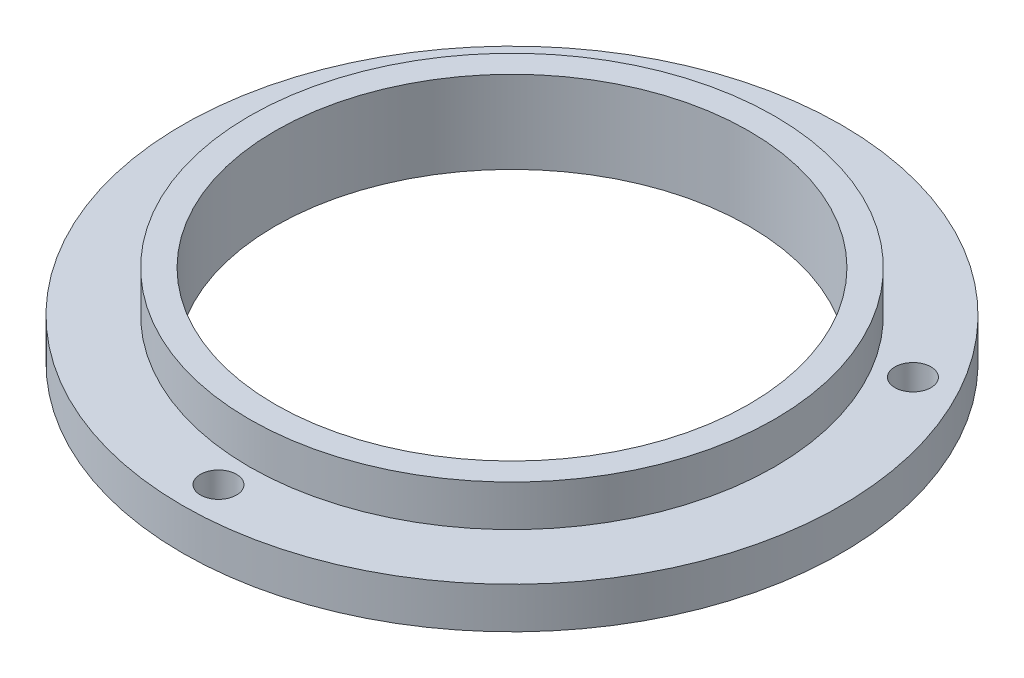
ISO-10303-21;
HEADER;
FILE_DESCRIPTION(('STEP AP214'),'2;1');
FILE_NAME('part.step','',(''),(''),'','','');
FILE_SCHEMA(('AUTOMOTIVE_DESIGN { 1 0 10303 214 1 1 1 1 }'));
ENDSEC;
DATA;
#1=APPLICATION_CONTEXT('core data for automotive mechanical design processes');
#2=APPLICATION_PROTOCOL_DEFINITION('international standard','automotive_design',2000,#1);
#3=PRODUCT_CONTEXT('',#1,'mechanical');
#4=PRODUCT('Part','Part','',(#3));
#5=PRODUCT_RELATED_PRODUCT_CATEGORY('part','',(#4));
#6=PRODUCT_DEFINITION_FORMATION('','',#4);
#7=PRODUCT_DEFINITION_CONTEXT('part definition',#1,'design');
#8=PRODUCT_DEFINITION('design','',#6,#7);
#9=PRODUCT_DEFINITION_SHAPE('','',#8);
#10=(LENGTH_UNIT() NAMED_UNIT(*) SI_UNIT(.MILLI.,.METRE.));
#11=(NAMED_UNIT(*) PLANE_ANGLE_UNIT() SI_UNIT($,.RADIAN.));
#12=(NAMED_UNIT(*) SI_UNIT($,.STERADIAN.) SOLID_ANGLE_UNIT());
#13=UNCERTAINTY_MEASURE_WITH_UNIT(LENGTH_MEASURE(1.E-05),#10,'distance_accuracy_value','');
#14=(GEOMETRIC_REPRESENTATION_CONTEXT(3) GLOBAL_UNCERTAINTY_ASSIGNED_CONTEXT((#13)) GLOBAL_UNIT_ASSIGNED_CONTEXT((#10,
#11,#12)) REPRESENTATION_CONTEXT('',''));
#15=CARTESIAN_POINT('',(0.,0.,0.));
#16=DIRECTION('',(0.,0.,1.));
#17=DIRECTION('',(1.,0.,0.));
#18=AXIS2_PLACEMENT_3D('',#15,#16,#17);
#19=CARTESIAN_POINT('',(0.,65.1723314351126,0.));
#20=DIRECTION('',(0.,1.,0.));
#21=DIRECTION('',(0.,0.,1.));
#22=AXIS2_PLACEMENT_3D('',#19,#20,#21);
#23=CYLINDRICAL_SURFACE('',#22,23.);
#24=CARTESIAN_POINT('',(0.,-4.,0.));
#25=DIRECTION('',(0.,1.,0.));
#26=DIRECTION('',(0.,0.,1.));
#27=AXIS2_PLACEMENT_3D('',#24,#25,#26);
#28=CIRCLE('',#27,23.);
#29=CARTESIAN_POINT('',(0.,-4.,23.));
#30=VERTEX_POINT('',#29);
#31=EDGE_CURVE('E10',#30,#30,#28,.T.);
#32=ORIENTED_EDGE('',*,*,#31,.F.);
#33=EDGE_LOOP('',(#32));
#34=FACE_BOUND('',#33,.T.);
#35=CARTESIAN_POINT('',(0.,4.,0.));
#36=DIRECTION('',(0.,1.,0.));
#37=DIRECTION('',(0.,0.,1.));
#38=AXIS2_PLACEMENT_3D('',#35,#36,#37);
#39=CIRCLE('',#38,23.);
#40=CARTESIAN_POINT('',(0.,4.,23.));
#41=VERTEX_POINT('',#40);
#42=EDGE_CURVE('E68',#41,#41,#39,.T.);
#43=ORIENTED_EDGE('',*,*,#42,.T.);
#44=EDGE_LOOP('',(#43));
#45=FACE_BOUND('',#44,.T.);
#46=ADVANCED_FACE('F39',(#34,#45),#23,.F.);
#47=CARTESIAN_POINT('',(23.,-4.,0.));
#48=DIRECTION('',(0.,1.,0.));
#49=DIRECTION('',(0.,0.,1.));
#50=AXIS2_PLACEMENT_3D('',#47,#48,#49);
#51=PLANE('',#50);
#52=CARTESIAN_POINT('',(0.,-4.,28.5));
#53=DIRECTION('',(0.,-1.,0.));
#54=DIRECTION('',(0.,0.,-1.));
#55=AXIS2_PLACEMENT_3D('',#52,#53,#54);
#56=CIRCLE('',#55,1.75);
#57=CARTESIAN_POINT('',(0.,-4.,26.75));
#58=VERTEX_POINT('',#57);
#59=EDGE_CURVE('E61',#58,#58,#56,.T.);
#60=ORIENTED_EDGE('',*,*,#59,.F.);
#61=EDGE_LOOP('',(#60));
#62=FACE_BOUND('',#61,.T.);
#63=CARTESIAN_POINT('',(24.6817240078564,-4.,-14.2500000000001));
#64=DIRECTION('',(0.,-1.,0.));
#65=DIRECTION('',(0.,0.,-1.));
#66=AXIS2_PLACEMENT_3D('',#63,#64,#65);
#67=CIRCLE('',#66,1.75);
#68=CARTESIAN_POINT('',(24.6817240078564,-4.,-16.0000000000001));
#69=VERTEX_POINT('',#68);
#70=EDGE_CURVE('E135',#69,#69,#67,.T.);
#71=ORIENTED_EDGE('',*,*,#70,.F.);
#72=EDGE_LOOP('',(#71));
#73=FACE_BOUND('',#72,.T.);
#74=CARTESIAN_POINT('',(-24.6817240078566,-4.,-14.2499999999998));
#75=DIRECTION('',(0.,-1.,0.));
#76=DIRECTION('',(0.,0.,-1.));
#77=AXIS2_PLACEMENT_3D('',#74,#75,#76);
#78=CIRCLE('',#77,1.75);
#79=CARTESIAN_POINT('',(-24.6817240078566,-4.,-15.9999999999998));
#80=VERTEX_POINT('',#79);
#81=EDGE_CURVE('E82',#80,#80,#78,.T.);
#82=ORIENTED_EDGE('',*,*,#81,.F.);
#83=EDGE_LOOP('',(#82));
#84=FACE_BOUND('',#83,.T.);
#85=CARTESIAN_POINT('',(0.,-4.,0.));
#86=DIRECTION('',(0.,1.,0.));
#87=DIRECTION('',(0.,0.,1.));
#88=AXIS2_PLACEMENT_3D('',#85,#86,#87);
#89=CIRCLE('',#88,32.);
#90=CARTESIAN_POINT('',(0.,-4.,32.));
#91=VERTEX_POINT('',#90);
#92=EDGE_CURVE('E47',#91,#91,#89,.T.);
#93=ORIENTED_EDGE('',*,*,#92,.F.);
#94=EDGE_LOOP('',(#93));
#95=FACE_BOUND('',#94,.T.);
#96=ORIENTED_EDGE('',*,*,#31,.T.);
#97=EDGE_LOOP('',(#96));
#98=FACE_BOUND('',#97,.T.);
#99=ADVANCED_FACE('F96',(#62,#73,#84,#95,#98),#51,.F.);
#100=CARTESIAN_POINT('',(0.,65.1723314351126,0.));
#101=DIRECTION('',(0.,1.,0.));
#102=DIRECTION('',(0.,0.,1.));
#103=AXIS2_PLACEMENT_3D('',#100,#101,#102);
#104=CYLINDRICAL_SURFACE('',#103,32.);
#105=CARTESIAN_POINT('',(0.,0.,0.));
#106=DIRECTION('',(0.,1.,0.));
#107=DIRECTION('',(0.,0.,1.));
#108=AXIS2_PLACEMENT_3D('',#105,#106,#107);
#109=CIRCLE('',#108,32.);
#110=CARTESIAN_POINT('',(0.,0.,32.));
#111=VERTEX_POINT('',#110);
#112=EDGE_CURVE('E53',#111,#111,#109,.T.);
#113=ORIENTED_EDGE('',*,*,#112,.F.);
#114=EDGE_LOOP('',(#113));
#115=FACE_BOUND('',#114,.T.);
#116=ORIENTED_EDGE('',*,*,#92,.T.);
#117=EDGE_LOOP('',(#116));
#118=FACE_BOUND('',#117,.T.);
#119=ADVANCED_FACE('F93',(#115,#118),#104,.T.);
#120=CARTESIAN_POINT('',(32.,0.,0.));
#121=DIRECTION('',(0.,-1.,0.));
#122=DIRECTION('',(0.,0.,-1.));
#123=AXIS2_PLACEMENT_3D('',#120,#121,#122);
#124=PLANE('',#123);
#125=CARTESIAN_POINT('',(0.,0.,28.5));
#126=DIRECTION('',(0.,-1.,0.));
#127=DIRECTION('',(0.,0.,-1.));
#128=AXIS2_PLACEMENT_3D('',#125,#126,#127);
#129=CIRCLE('',#128,1.75);
#130=CARTESIAN_POINT('',(0.,0.,26.75));
#131=VERTEX_POINT('',#130);
#132=EDGE_CURVE('E42',#131,#131,#129,.T.);
#133=ORIENTED_EDGE('',*,*,#132,.T.);
#134=EDGE_LOOP('',(#133));
#135=FACE_BOUND('',#134,.T.);
#136=CARTESIAN_POINT('',(24.6817240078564,0.,-14.2500000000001));
#137=DIRECTION('',(0.,-1.,0.));
#138=DIRECTION('',(0.,0.,-1.));
#139=AXIS2_PLACEMENT_3D('',#136,#137,#138);
#140=CIRCLE('',#139,1.75);
#141=CARTESIAN_POINT('',(24.6817240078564,0.,-16.0000000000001));
#142=VERTEX_POINT('',#141);
#143=EDGE_CURVE('E60',#142,#142,#140,.T.);
#144=ORIENTED_EDGE('',*,*,#143,.T.);
#145=EDGE_LOOP('',(#144));
#146=FACE_BOUND('',#145,.T.);
#147=CARTESIAN_POINT('',(-24.6817240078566,0.,-14.2499999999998));
#148=DIRECTION('',(0.,-1.,0.));
#149=DIRECTION('',(0.,0.,-1.));
#150=AXIS2_PLACEMENT_3D('',#147,#148,#149);
#151=CIRCLE('',#150,1.75);
#152=CARTESIAN_POINT('',(-24.6817240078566,0.,-15.9999999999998));
#153=VERTEX_POINT('',#152);
#154=EDGE_CURVE('E57',#153,#153,#151,.T.);
#155=ORIENTED_EDGE('',*,*,#154,.T.);
#156=EDGE_LOOP('',(#155));
#157=FACE_BOUND('',#156,.T.);
#158=CARTESIAN_POINT('',(0.,0.,0.));
#159=DIRECTION('',(0.,1.,0.));
#160=DIRECTION('',(0.,0.,1.));
#161=AXIS2_PLACEMENT_3D('',#158,#159,#160);
#162=CIRCLE('',#161,25.5);
#163=CARTESIAN_POINT('',(0.,0.,25.5));
#164=VERTEX_POINT('',#163);
#165=EDGE_CURVE('E79',#164,#164,#162,.T.);
#166=ORIENTED_EDGE('',*,*,#165,.F.);
#167=EDGE_LOOP('',(#166));
#168=FACE_BOUND('',#167,.T.);
#169=ORIENTED_EDGE('',*,*,#112,.T.);
#170=EDGE_LOOP('',(#169));
#171=FACE_BOUND('',#170,.T.);
#172=ADVANCED_FACE('F91',(#135,#146,#157,#168,#171),#124,.F.);
#173=CARTESIAN_POINT('',(0.,65.1723314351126,0.));
#174=DIRECTION('',(0.,1.,0.));
#175=DIRECTION('',(0.,0.,1.));
#176=AXIS2_PLACEMENT_3D('',#173,#174,#175);
#177=CYLINDRICAL_SURFACE('',#176,25.5);
#178=CARTESIAN_POINT('',(0.,4.,0.));
#179=DIRECTION('',(0.,1.,0.));
#180=DIRECTION('',(0.,0.,1.));
#181=AXIS2_PLACEMENT_3D('',#178,#179,#180);
#182=CIRCLE('',#181,25.5);
#183=CARTESIAN_POINT('',(0.,4.,25.5));
#184=VERTEX_POINT('',#183);
#185=EDGE_CURVE('E73',#184,#184,#182,.T.);
#186=ORIENTED_EDGE('',*,*,#185,.F.);
#187=EDGE_LOOP('',(#186));
#188=FACE_BOUND('',#187,.T.);
#189=ORIENTED_EDGE('',*,*,#165,.T.);
#190=EDGE_LOOP('',(#189));
#191=FACE_BOUND('',#190,.T.);
#192=ADVANCED_FACE('F111',(#188,#191),#177,.T.);
#193=CARTESIAN_POINT('',(25.5,4.,0.));
#194=DIRECTION('',(0.,-1.,0.));
#195=DIRECTION('',(0.,0.,-1.));
#196=AXIS2_PLACEMENT_3D('',#193,#194,#195);
#197=PLANE('',#196);
#198=ORIENTED_EDGE('',*,*,#42,.F.);
#199=EDGE_LOOP('',(#198));
#200=FACE_BOUND('',#199,.T.);
#201=ORIENTED_EDGE('',*,*,#185,.T.);
#202=EDGE_LOOP('',(#201));
#203=FACE_BOUND('',#202,.T.);
#204=ADVANCED_FACE('F114',(#200,#203),#197,.F.);
#205=CARTESIAN_POINT('',(-24.6817240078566,4.,-14.2499999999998));
#206=DIRECTION('',(0.,-1.,0.));
#207=DIRECTION('',(0.,0.,-1.));
#208=AXIS2_PLACEMENT_3D('',#205,#206,#207);
#209=CYLINDRICAL_SURFACE('',#208,1.75);
#210=ORIENTED_EDGE('',*,*,#81,.T.);
#211=EDGE_LOOP('',(#210));
#212=FACE_BOUND('',#211,.T.);
#213=ORIENTED_EDGE('',*,*,#154,.F.);
#214=EDGE_LOOP('',(#213));
#215=FACE_BOUND('',#214,.T.);
#216=ADVANCED_FACE('F118',(#212,#215),#209,.F.);
#217=CARTESIAN_POINT('',(24.6817240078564,4.,-14.2500000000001));
#218=DIRECTION('',(0.,-1.,0.));
#219=DIRECTION('',(0.,0.,-1.));
#220=AXIS2_PLACEMENT_3D('',#217,#218,#219);
#221=CYLINDRICAL_SURFACE('',#220,1.75);
#222=ORIENTED_EDGE('',*,*,#70,.T.);
#223=EDGE_LOOP('',(#222));
#224=FACE_BOUND('',#223,.T.);
#225=ORIENTED_EDGE('',*,*,#143,.F.);
#226=EDGE_LOOP('',(#225));
#227=FACE_BOUND('',#226,.T.);
#228=ADVANCED_FACE('F122',(#224,#227),#221,.F.);
#229=CARTESIAN_POINT('',(0.,4.,28.5));
#230=DIRECTION('',(0.,-1.,0.));
#231=DIRECTION('',(0.,0.,-1.));
#232=AXIS2_PLACEMENT_3D('',#229,#230,#231);
#233=CYLINDRICAL_SURFACE('',#232,1.75);
#234=ORIENTED_EDGE('',*,*,#59,.T.);
#235=EDGE_LOOP('',(#234));
#236=FACE_BOUND('',#235,.T.);
#237=ORIENTED_EDGE('',*,*,#132,.F.);
#238=EDGE_LOOP('',(#237));
#239=FACE_BOUND('',#238,.T.);
#240=ADVANCED_FACE('F126',(#236,#239),#233,.F.);
#241=CLOSED_SHELL('',(#46,#99,#119,#172,#192,#204,#216,#228,#240));
#242=MANIFOLD_SOLID_BREP('B2',#241);
#243=ADVANCED_BREP_SHAPE_REPRESENTATION('',(#18,#242),#14);
#244=SHAPE_DEFINITION_REPRESENTATION(#9,#243);
ENDSEC;
END-ISO-10303-21;
